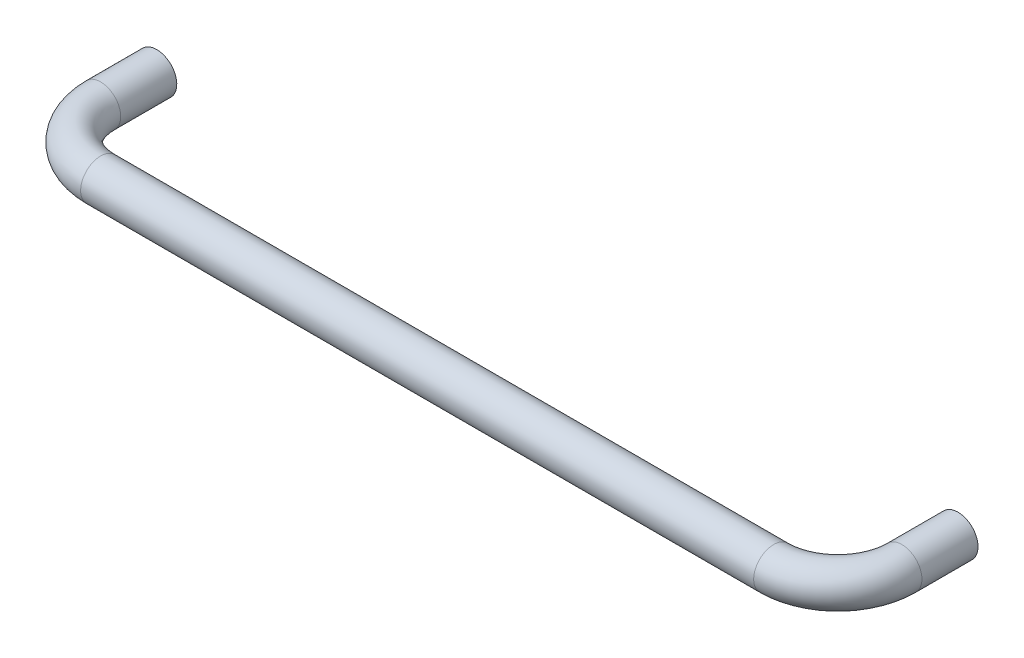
ISO-10303-21;
HEADER;
FILE_DESCRIPTION(('STEP AP214'),'2;1');
FILE_NAME('part.step','',(''),(''),'','','');
FILE_SCHEMA(('AUTOMOTIVE_DESIGN { 1 0 10303 214 1 1 1 1 }'));
ENDSEC;
DATA;
#1=APPLICATION_CONTEXT('core data for automotive mechanical design processes');
#2=APPLICATION_PROTOCOL_DEFINITION('international standard','automotive_design',2000,#1);
#3=PRODUCT_CONTEXT('',#1,'mechanical');
#4=PRODUCT('Part','Part','',(#3));
#5=PRODUCT_RELATED_PRODUCT_CATEGORY('part','',(#4));
#6=PRODUCT_DEFINITION_FORMATION('','',#4);
#7=PRODUCT_DEFINITION_CONTEXT('part definition',#1,'design');
#8=PRODUCT_DEFINITION('design','',#6,#7);
#9=PRODUCT_DEFINITION_SHAPE('','',#8);
#10=(LENGTH_UNIT() NAMED_UNIT(*) SI_UNIT(.MILLI.,.METRE.));
#11=(NAMED_UNIT(*) PLANE_ANGLE_UNIT() SI_UNIT($,.RADIAN.));
#12=(NAMED_UNIT(*) SI_UNIT($,.STERADIAN.) SOLID_ANGLE_UNIT());
#13=UNCERTAINTY_MEASURE_WITH_UNIT(LENGTH_MEASURE(1.E-05),#10,'distance_accuracy_value','');
#14=(GEOMETRIC_REPRESENTATION_CONTEXT(3) GLOBAL_UNCERTAINTY_ASSIGNED_CONTEXT((#13)) GLOBAL_UNIT_ASSIGNED_CONTEXT((#10,
#11,#12)) REPRESENTATION_CONTEXT('',''));
#15=CARTESIAN_POINT('',(0.,0.,0.));
#16=DIRECTION('',(0.,0.,1.));
#17=DIRECTION('',(1.,0.,0.));
#18=AXIS2_PLACEMENT_3D('',#15,#16,#17);
#19=CARTESIAN_POINT('',(399.992502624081,0.,28.));
#20=DIRECTION('',(0.,0.,-1.));
#21=DIRECTION('',(0.,1.,0.));
#22=AXIS2_PLACEMENT_3D('',#19,#20,#21);
#23=CYLINDRICAL_SURFACE('',#22,10.);
#24=CARTESIAN_POINT('',(399.992502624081,0.,28.));
#25=DIRECTION('',(0.,0.,-1.));
#26=DIRECTION('',(0.,-1.,0.));
#27=AXIS2_PLACEMENT_3D('',#24,#25,#26);
#28=CIRCLE('',#27,10.);
#29=CARTESIAN_POINT('',(409.992502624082,0.,28.));
#30=VERTEX_POINT('',#29);
#31=EDGE_CURVE('E18',#30,#30,#28,.T.);
#32=ORIENTED_EDGE('',*,*,#31,.T.);
#33=EDGE_LOOP('',(#32));
#34=FACE_BOUND('',#33,.T.);
#35=CARTESIAN_POINT('',(399.992502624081,0.,0.));
#36=DIRECTION('',(0.,0.,-1.));
#37=DIRECTION('',(0.,-1.,0.));
#38=AXIS2_PLACEMENT_3D('',#35,#36,#37);
#39=CIRCLE('',#38,10.);
#40=CARTESIAN_POINT('',(399.992502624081,-9.99999999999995,0.));
#41=VERTEX_POINT('',#40);
#42=EDGE_CURVE('E8',#41,#41,#39,.T.);
#43=ORIENTED_EDGE('',*,*,#42,.F.);
#44=EDGE_LOOP('',(#43));
#45=FACE_BOUND('',#44,.T.);
#46=ADVANCED_FACE('F12',(#34,#45),#23,.T.);
#47=CARTESIAN_POINT('',(367.992502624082,0.,28.));
#48=DIRECTION('',(0.,1.,0.));
#49=DIRECTION('',(-1.,0.,0.));
#50=AXIS2_PLACEMENT_3D('',#47,#48,#49);
#51=TOROIDAL_SURFACE('',#50,32.,10.);
#52=CARTESIAN_POINT('',(367.992502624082,0.,60.));
#53=DIRECTION('',(1.,0.,0.));
#54=DIRECTION('',(0.,-1.,0.));
#55=AXIS2_PLACEMENT_3D('',#52,#53,#54);
#56=CIRCLE('',#55,10.);
#57=CARTESIAN_POINT('',(367.992502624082,0.,70.));
#58=VERTEX_POINT('',#57);
#59=EDGE_CURVE('E22',#58,#58,#56,.T.);
#60=CARTESIAN_POINT('',(367.992502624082,0.,28.));
#61=DIRECTION('',(0.,1.,0.));
#62=DIRECTION('',(-1.,0.,0.));
#63=AXIS2_PLACEMENT_3D('',#60,#61,#62);
#64=CIRCLE('',#63,42.);
#65=EDGE_CURVE('',#58,#30,#64,.T.);
#66=ORIENTED_EDGE('',*,*,#59,.T.);
#67=ORIENTED_EDGE('',*,*,#31,.F.);
#68=ORIENTED_EDGE('',*,*,#65,.T.);
#69=ORIENTED_EDGE('',*,*,#65,.F.);
#70=EDGE_LOOP('',(#66,#68,#67,#69));
#71=FACE_BOUND('',#70,.T.);
#72=ADVANCED_FACE('F81',(#71),#51,.T.);
#73=CARTESIAN_POINT('',(31.9925026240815,0.,60.));
#74=DIRECTION('',(1.,0.,0.));
#75=DIRECTION('',(0.,0.,1.));
#76=AXIS2_PLACEMENT_3D('',#73,#74,#75);
#77=CYLINDRICAL_SURFACE('',#76,10.);
#78=CARTESIAN_POINT('',(31.9925026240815,0.,60.));
#79=DIRECTION('',(1.,0.,0.));
#80=DIRECTION('',(0.,-1.,0.));
#81=AXIS2_PLACEMENT_3D('',#78,#79,#80);
#82=CIRCLE('',#81,10.);
#83=CARTESIAN_POINT('',(31.9925026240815,0.,70.));
#84=VERTEX_POINT('',#83);
#85=EDGE_CURVE('E26',#84,#84,#82,.T.);
#86=ORIENTED_EDGE('',*,*,#85,.T.);
#87=EDGE_LOOP('',(#86));
#88=FACE_BOUND('',#87,.T.);
#89=ORIENTED_EDGE('',*,*,#59,.F.);
#90=EDGE_LOOP('',(#89));
#91=FACE_BOUND('',#90,.T.);
#92=ADVANCED_FACE('F77',(#88,#91),#77,.T.);
#93=CARTESIAN_POINT('',(31.9925026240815,0.,28.));
#94=DIRECTION('',(0.,1.,0.));
#95=DIRECTION('',(-1.,0.,0.));
#96=AXIS2_PLACEMENT_3D('',#93,#94,#95);
#97=TOROIDAL_SURFACE('',#96,32.,10.);
#98=CARTESIAN_POINT('',(-0.00749737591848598,0.,28.));
#99=DIRECTION('',(0.,0.,1.));
#100=DIRECTION('',(0.,-1.,0.));
#101=AXIS2_PLACEMENT_3D('',#98,#99,#100);
#102=CIRCLE('',#101,10.);
#103=CARTESIAN_POINT('',(-10.0074973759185,0.,28.));
#104=VERTEX_POINT('',#103);
#105=EDGE_CURVE('E31',#104,#104,#102,.T.);
#106=CARTESIAN_POINT('',(31.9925026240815,0.,28.));
#107=DIRECTION('',(0.,1.,0.));
#108=DIRECTION('',(-1.,0.,0.));
#109=AXIS2_PLACEMENT_3D('',#106,#107,#108);
#110=CIRCLE('',#109,42.);
#111=EDGE_CURVE('',#104,#84,#110,.T.);
#112=ORIENTED_EDGE('',*,*,#105,.T.);
#113=ORIENTED_EDGE('',*,*,#85,.F.);
#114=ORIENTED_EDGE('',*,*,#111,.T.);
#115=ORIENTED_EDGE('',*,*,#111,.F.);
#116=EDGE_LOOP('',(#112,#114,#113,#115));
#117=FACE_BOUND('',#116,.T.);
#118=ADVANCED_FACE('F64',(#117),#97,.T.);
#119=CARTESIAN_POINT('',(-0.00749737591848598,0.,28.));
#120=DIRECTION('',(0.,0.,-1.));
#121=DIRECTION('',(0.,1.,0.));
#122=AXIS2_PLACEMENT_3D('',#119,#120,#121);
#123=CYLINDRICAL_SURFACE('',#122,10.);
#124=ORIENTED_EDGE('',*,*,#105,.F.);
#125=EDGE_LOOP('',(#124));
#126=FACE_BOUND('',#125,.T.);
#127=CARTESIAN_POINT('',(-0.00749737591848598,0.,0.));
#128=DIRECTION('',(0.,0.,1.));
#129=DIRECTION('',(0.,-1.,0.));
#130=AXIS2_PLACEMENT_3D('',#127,#128,#129);
#131=CIRCLE('',#130,10.);
#132=CARTESIAN_POINT('',(-0.00749737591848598,-9.99999999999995,0.));
#133=VERTEX_POINT('',#132);
#134=EDGE_CURVE('E34',#133,#133,#131,.T.);
#135=ORIENTED_EDGE('',*,*,#134,.T.);
#136=EDGE_LOOP('',(#135));
#137=FACE_BOUND('',#136,.T.);
#138=ADVANCED_FACE('F62',(#126,#137),#123,.T.);
#139=CARTESIAN_POINT('',(399.992502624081,0.,0.));
#140=DIRECTION('',(0.,0.,-1.));
#141=DIRECTION('',(0.,-1.,0.));
#142=AXIS2_PLACEMENT_3D('',#139,#140,#141);
#143=PLANE('',#142);
#144=CARTESIAN_POINT('',(399.985005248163,0.,0.));
#145=DIRECTION('',(0.,0.,-1.));
#146=DIRECTION('',(0.,-1.,0.));
#147=AXIS2_PLACEMENT_3D('',#144,#145,#146);
#148=CIRCLE('',#147,4.53099737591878);
#149=CARTESIAN_POINT('',(399.985005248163,-4.53099737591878,0.));
#150=VERTEX_POINT('',#149);
#151=EDGE_CURVE('E52',#150,#150,#148,.T.);
#152=ORIENTED_EDGE('',*,*,#151,.F.);
#153=EDGE_LOOP('',(#152));
#154=FACE_BOUND('',#153,.T.);
#155=ORIENTED_EDGE('',*,*,#42,.T.);
#156=EDGE_LOOP('',(#155));
#157=FACE_BOUND('',#156,.T.);
#158=ADVANCED_FACE('F59',(#154,#157),#143,.T.);
#159=CARTESIAN_POINT('',(-0.00749737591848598,0.,0.));
#160=DIRECTION('',(0.,0.,1.));
#161=DIRECTION('',(0.,-1.,0.));
#162=AXIS2_PLACEMENT_3D('',#159,#160,#161);
#163=PLANE('',#162);
#164=CARTESIAN_POINT('',(0.,0.,0.));
#165=DIRECTION('',(0.,0.,1.));
#166=DIRECTION('',(0.,-1.,0.));
#167=AXIS2_PLACEMENT_3D('',#164,#165,#166);
#168=CIRCLE('',#167,4.53099737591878);
#169=CARTESIAN_POINT('',(0.,-4.53099737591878,0.));
#170=VERTEX_POINT('',#169);
#171=EDGE_CURVE('E43',#170,#170,#168,.T.);
#172=ORIENTED_EDGE('',*,*,#171,.T.);
#173=EDGE_LOOP('',(#172));
#174=FACE_BOUND('',#173,.T.);
#175=ORIENTED_EDGE('',*,*,#134,.F.);
#176=EDGE_LOOP('',(#175));
#177=FACE_BOUND('',#176,.T.);
#178=ADVANCED_FACE('F61',(#174,#177),#163,.F.);
#179=CARTESIAN_POINT('',(-4.,0.,15.));
#180=DIRECTION('',(0.,0.,-1.));
#181=DIRECTION('',(0.,1.,0.));
#182=AXIS2_PLACEMENT_3D('',#179,#180,#181);
#183=PLANE('',#182);
#184=CARTESIAN_POINT('',(0.,0.,15.));
#185=DIRECTION('',(0.,0.,1.));
#186=DIRECTION('',(0.,-1.,0.));
#187=AXIS2_PLACEMENT_3D('',#184,#185,#186);
#188=CIRCLE('',#187,4.00000000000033);
#189=CARTESIAN_POINT('',(0.,-4.00000000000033,15.));
#190=VERTEX_POINT('',#189);
#191=EDGE_CURVE('E37',#190,#190,#188,.T.);
#192=ORIENTED_EDGE('',*,*,#191,.F.);
#193=EDGE_LOOP('',(#192));
#194=FACE_BOUND('',#193,.T.);
#195=ADVANCED_FACE('F71',(#194),#183,.T.);
#196=CARTESIAN_POINT('',(0.,0.,28.0149947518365));
#197=DIRECTION('',(0.,0.,1.));
#198=DIRECTION('',(0.,-1.,0.));
#199=AXIS2_PLACEMENT_3D('',#196,#197,#198);
#200=CYLINDRICAL_SURFACE('',#199,4.00000000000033);
#201=ORIENTED_EDGE('',*,*,#191,.T.);
#202=EDGE_LOOP('',(#201));
#203=FACE_BOUND('',#202,.T.);
#204=CARTESIAN_POINT('',(0.,0.,0.530997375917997));
#205=DIRECTION('',(0.,0.,1.));
#206=DIRECTION('',(0.,-1.,0.));
#207=AXIS2_PLACEMENT_3D('',#204,#205,#206);
#208=CIRCLE('',#207,4.00000000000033);
#209=CARTESIAN_POINT('',(0.,-4.00000000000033,0.530997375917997));
#210=VERTEX_POINT('',#209);
#211=EDGE_CURVE('E40',#210,#210,#208,.T.);
#212=ORIENTED_EDGE('',*,*,#211,.F.);
#213=EDGE_LOOP('',(#212));
#214=FACE_BOUND('',#213,.T.);
#215=ADVANCED_FACE('F137',(#203,#214),#200,.F.);
#216=CARTESIAN_POINT('',(0.,0.,0.530997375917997));
#217=DIRECTION('',(0.,0.,-1.));
#218=DIRECTION('',(0.,1.,0.));
#219=AXIS2_PLACEMENT_3D('',#216,#217,#218);
#220=CONICAL_SURFACE('',#219,4.00000000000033,0.7853981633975);
#221=ORIENTED_EDGE('',*,*,#171,.F.);
#222=EDGE_LOOP('',(#221));
#223=FACE_BOUND('',#222,.T.);
#224=ORIENTED_EDGE('',*,*,#211,.T.);
#225=EDGE_LOOP('',(#224));
#226=FACE_BOUND('',#225,.T.);
#227=ADVANCED_FACE('F145',(#223,#226),#220,.F.);
#228=CARTESIAN_POINT('',(403.985005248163,0.,15.));
#229=DIRECTION('',(0.,0.,-1.));
#230=DIRECTION('',(0.,1.,0.));
#231=AXIS2_PLACEMENT_3D('',#228,#229,#230);
#232=PLANE('',#231);
#233=CARTESIAN_POINT('',(399.985005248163,0.,15.));
#234=DIRECTION('',(0.,0.,-1.));
#235=DIRECTION('',(0.,-1.,0.));
#236=AXIS2_PLACEMENT_3D('',#233,#234,#235);
#237=CIRCLE('',#236,4.00000000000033);
#238=CARTESIAN_POINT('',(399.985005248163,-4.00000000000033,15.));
#239=VERTEX_POINT('',#238);
#240=EDGE_CURVE('E46',#239,#239,#237,.T.);
#241=ORIENTED_EDGE('',*,*,#240,.T.);
#242=EDGE_LOOP('',(#241));
#243=FACE_BOUND('',#242,.T.);
#244=ADVANCED_FACE('F154',(#243),#232,.T.);
#245=CARTESIAN_POINT('',(399.985005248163,0.,28.0149947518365));
#246=DIRECTION('',(0.,0.,1.));
#247=DIRECTION('',(0.,-1.,0.));
#248=AXIS2_PLACEMENT_3D('',#245,#246,#247);
#249=CYLINDRICAL_SURFACE('',#248,4.00000000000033);
#250=ORIENTED_EDGE('',*,*,#240,.F.);
#251=EDGE_LOOP('',(#250));
#252=FACE_BOUND('',#251,.T.);
#253=CARTESIAN_POINT('',(399.985005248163,0.,0.530997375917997));
#254=DIRECTION('',(0.,0.,-1.));
#255=DIRECTION('',(0.,-1.,0.));
#256=AXIS2_PLACEMENT_3D('',#253,#254,#255);
#257=CIRCLE('',#256,4.00000000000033);
#258=CARTESIAN_POINT('',(399.985005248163,-4.00000000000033,0.530997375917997));
#259=VERTEX_POINT('',#258);
#260=EDGE_CURVE('E49',#259,#259,#257,.T.);
#261=ORIENTED_EDGE('',*,*,#260,.T.);
#262=EDGE_LOOP('',(#261));
#263=FACE_BOUND('',#262,.T.);
#264=ADVANCED_FACE('F163',(#252,#263),#249,.F.);
#265=CARTESIAN_POINT('',(399.985005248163,0.,0.530997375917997));
#266=DIRECTION('',(0.,0.,-1.));
#267=DIRECTION('',(0.,1.,0.));
#268=AXIS2_PLACEMENT_3D('',#265,#266,#267);
#269=CONICAL_SURFACE('',#268,4.00000000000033,0.7853981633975);
#270=ORIENTED_EDGE('',*,*,#151,.T.);
#271=EDGE_LOOP('',(#270));
#272=FACE_BOUND('',#271,.T.);
#273=ORIENTED_EDGE('',*,*,#260,.F.);
#274=EDGE_LOOP('',(#273));
#275=FACE_BOUND('',#274,.T.);
#276=ADVANCED_FACE('F56',(#272,#275),#269,.F.);
#277=CLOSED_SHELL('',(#46,#72,#92,#118,#138,#158,#178,#195,#215,#227,#244,#264,#276));
#278=MANIFOLD_SOLID_BREP('B1',#277);
#279=ADVANCED_BREP_SHAPE_REPRESENTATION('',(#18,#278),#14);
#280=SHAPE_DEFINITION_REPRESENTATION(#9,#279);
ENDSEC;
END-ISO-10303-21;
